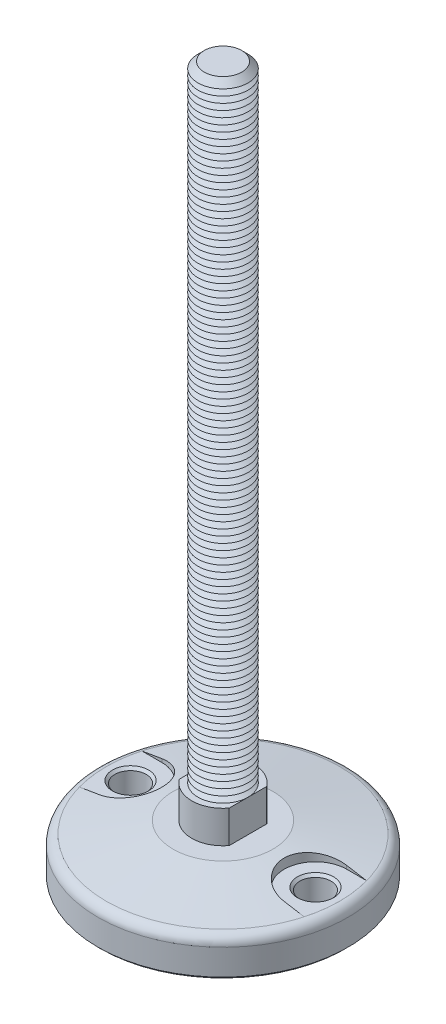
from build123d import *

# Parameters (mm, degrees)
FILLET1_R                = 4
SKETCH3_R                = 12.5
BOSS_EXTRUDE1_DEPTH      = 13
CUT_EXTRUDE1_START       = -13
CUT_EXTRUDE1_DEPTH       = 13
SKETCH5_R                = 10
BOSS_EXTRUDE2_DEPTH      = 250
CHAMFER1_SIZE            = 2.5
LPATTERN1_COUNT          = 99
LPATTERN1_PITCH          = 2.5
CUT_EXTRUDE4_DEPTH       = 4.7
SKETCH10_R               = 6.25
CUT_EXTRUDE5_DEPTH       = 15.3
CHAMFER2_SIZE            = 1
CHAMFER2_OF_MIRROR1_SIZE = 1
CHAMFER3_SIZE            = 1


with BuildPart() as part:
    # Sketch2 → Revolve1 (revolve)
    with BuildSketch(Plane(origin=(0, 0, 0), x_dir=(0, 0, -1), z_dir=(1, 0, 0))):
        Polygon((0, 0), (-20, 0), (-50, -5.289809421), (-50, -20), (0, -20), align=None)
    revolve(axis=Axis((0, 61.338865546, 0), (0, -1, 0)))

    # Fillet1
    fillet1_edges = [part.edges().sort_by_distance(p)[0] for p in [
        (0, -5.289809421, -50),
    ]]
    fillet(fillet1_edges, radius=FILLET1_R)

    # Sketch3 → Boss-Extrude1 (add)
    with BuildSketch(Plane(origin=(0, 0, 0), x_dir=(1, 0, 0), z_dir=(0, 1, 0))):
        with Locations(Location((0, 0, 0), (0, 0, 90))):
            Circle(SKETCH3_R)
    extrude(amount=BOSS_EXTRUDE1_DEPTH)

    # Sketch4 → Cut-Extrude1 (cut)
    with BuildSketch(Plane(origin=(0, 13, 0), x_dir=(1, 0, 0), z_dir=(0, 1, 0)).offset(CUT_EXTRUDE1_START)):
        with BuildLine():
            Line((-10, 7.5), (-10, -7.5))
            ThreePointArc((-10, -7.5), (-12.5, 0), (-10, 7.5))
        make_face()
        with BuildLine():
            Line((10, -7.5), (10, 7.5))
            ThreePointArc((10, 7.5), (12.5, 0), (10, -7.5))
        make_face()
    extrude(amount=CUT_EXTRUDE1_DEPTH, mode=Mode.SUBTRACT)

    # Sketch5 → Boss-Extrude2 (add)
    with BuildSketch(Plane(origin=(0, 13, 0), x_dir=(1, 0, 0), z_dir=(0, 1, 0))):
        with Locations(Location((0, 0, 0), (0, 0, 180))):
            Circle(SKETCH5_R)
    extrude(amount=BOSS_EXTRUDE2_DEPTH)

    # Chamfer1
    chamfer1_edges = [part.edges().sort_by_distance(p)[0] for p in [
        (10, 263, 0),
    ]]
    chamfer(chamfer1_edges, length=CHAMFER1_SIZE)

    # Sketch6 → Cut-Revolve1 (revolve, cut)
    with BuildSketch(Plane(origin=(0, 0, 0), x_dir=(0, 0, -1), z_dir=(1, 0, 0))):
        Polygon((-10, 13), (-7.834936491, 14.25), (-10, 15.5), align=None)
    cut_revolve1 = revolve(axis=Axis((0, 61.338865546, 0), (0, -1, 0)), mode=Mode.SUBTRACT)

    # LPattern1: Cut-Revolve1 ×99
    with Locations(*[(0, i * LPATTERN1_PITCH, 0) for i in range(1, LPATTERN1_COUNT)]):
        add(cut_revolve1, mode=Mode.SUBTRACT)

    # Sketch8 → Cut-Extrude4 (cut)
    with BuildSketch(Plane(origin=(0, 0, 0), x_dir=(1, 0, 0), z_dir=(0, 1, 0))):
        with BuildLine():
            Line((-37, 12.5), (-44.990387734, 12.5))
            ThreePointArc((-44.990387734, 12.5), (-46.694592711, 0), (-44.990387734, -12.5))
            Line((-44.990387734, -12.5), (-37, -12.5))
            ThreePointArc((-37, -12.5), (-24.5, 0), (-37, 12.5))
        make_face()
    cut_extrude4 = extrude(amount=-CUT_EXTRUDE4_DEPTH, mode=Mode.SUBTRACT)

    # Sketch10 → Cut-Extrude5 (cut)
    with BuildSketch(Plane(origin=(0, -4.7, 0), x_dir=(1, 0, 0), z_dir=(0, 1, 0))):
        with Locations(Location((-37, 0, 0), (0, 0, 270))):
            Circle(SKETCH10_R)
    cut_extrude5 = extrude(amount=-CUT_EXTRUDE5_DEPTH, mode=Mode.SUBTRACT)

    # Chamfer2
    chamfer2_edges = [part.edges().sort_by_distance(p)[0] for p in [
        (-37, -4.7, -6.25),
        (-37, -20, -6.25),
    ]]
    chamfer(chamfer2_edges, length=CHAMFER2_SIZE)

    # Mirror1: Cut-Extrude4, Cut-Extrude5 across plane
    add(cut_extrude4.mirror(Plane(origin=(0, 0, 0), x_dir=(0, 0, 1), z_dir=(1, 0, 0))), mode=Mode.SUBTRACT)
    add(cut_extrude5.mirror(Plane(origin=(0, 0, 0), x_dir=(0, 0, 1), z_dir=(1, 0, 0))), mode=Mode.SUBTRACT)

    # Chamfer2 of Mirror1
    chamfer2_of_mirror1_edges = [part.edges().sort_by_distance(p)[0] for p in [
        (37, -4.7, -6.25),
        (37, -20, -6.25),
    ]]
    chamfer(chamfer2_of_mirror1_edges, length=CHAMFER2_OF_MIRROR1_SIZE)

    # Chamfer3
    chamfer3_edges = [part.edges().sort_by_distance(p)[0] for p in [
        (0, -20, -50),
    ]]
    chamfer(chamfer3_edges, length=CHAMFER3_SIZE)


solid = part.part
